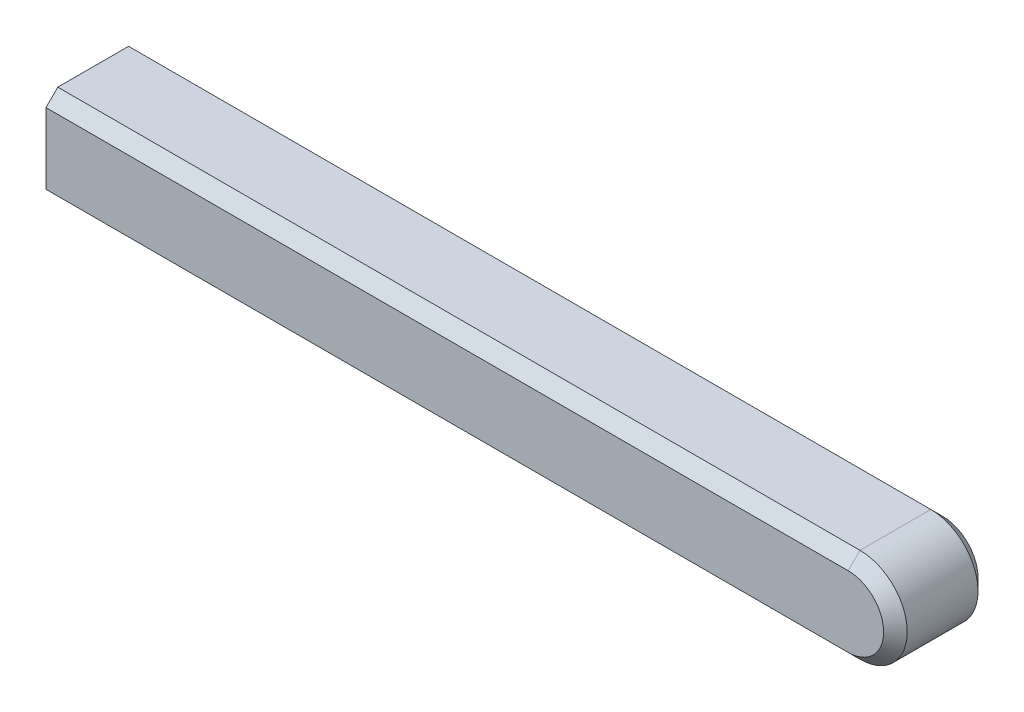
from build123d import *

# Parameters (mm, degrees)
EXTRUDE1_DEPTH = 2
CHAMFER1_SIZE  = 0.25


with BuildPart() as part:
    # body → Extrude1 (new body)
    with BuildSketch(Plane.XY):
        with BuildLine():
            Line((0, 0), (17, 0))
            ThreePointArc((17, 0), (18, 1), (17, 2))
            Line((17, 2), (0, 2))
            Line((0, 2), (0, 0))
        make_face()
    extrude(amount=EXTRUDE1_DEPTH)

    # Chamfer1
    chamfer1_edges = [part.edges().sort_by_distance(p)[0] for p in [
        (18, 1, 2),
        (8.5, 2, 2),
        (8.5, 2, 0),
        (18, 1, 0),
        (8.5, 0, 0),
        (8.5, 0, 2),
    ]]
    chamfer(chamfer1_edges, length=CHAMFER1_SIZE)


solid = part.part
